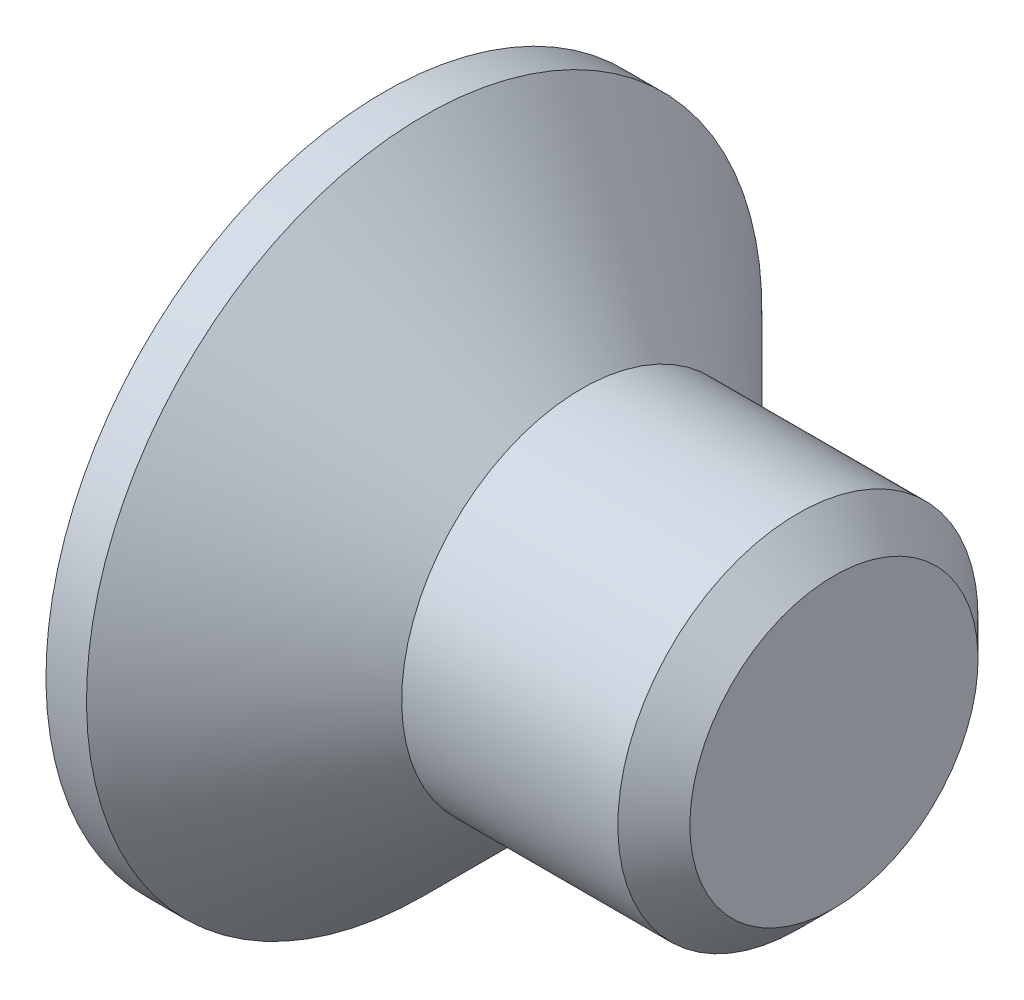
ISO-10303-21;
HEADER;
FILE_DESCRIPTION(('STEP AP214'),'2;1');
FILE_NAME('part.step','',(''),(''),'','','');
FILE_SCHEMA(('AUTOMOTIVE_DESIGN { 1 0 10303 214 1 1 1 1 }'));
ENDSEC;
DATA;
#1=APPLICATION_CONTEXT('core data for automotive mechanical design processes');
#2=APPLICATION_PROTOCOL_DEFINITION('international standard','automotive_design',2000,#1);
#3=PRODUCT_CONTEXT('',#1,'mechanical');
#4=PRODUCT('Part','Part','',(#3));
#5=PRODUCT_RELATED_PRODUCT_CATEGORY('part','',(#4));
#6=PRODUCT_DEFINITION_FORMATION('','',#4);
#7=PRODUCT_DEFINITION_CONTEXT('part definition',#1,'design');
#8=PRODUCT_DEFINITION('design','',#6,#7);
#9=PRODUCT_DEFINITION_SHAPE('','',#8);
#10=(LENGTH_UNIT() NAMED_UNIT(*) SI_UNIT(.MILLI.,.METRE.));
#11=(NAMED_UNIT(*) PLANE_ANGLE_UNIT() SI_UNIT($,.RADIAN.));
#12=(NAMED_UNIT(*) SI_UNIT($,.STERADIAN.) SOLID_ANGLE_UNIT());
#13=UNCERTAINTY_MEASURE_WITH_UNIT(LENGTH_MEASURE(1.E-05),#10,'distance_accuracy_value','');
#14=(GEOMETRIC_REPRESENTATION_CONTEXT(3) GLOBAL_UNCERTAINTY_ASSIGNED_CONTEXT((#13)) GLOBAL_UNIT_ASSIGNED_CONTEXT((#10,
#11,#12)) REPRESENTATION_CONTEXT('',''));
#15=CARTESIAN_POINT('',(0.,0.,0.));
#16=DIRECTION('',(0.,0.,1.));
#17=DIRECTION('',(1.,0.,0.));
#18=AXIS2_PLACEMENT_3D('',#15,#16,#17);
#19=CARTESIAN_POINT('',(0.,0.,0.));
#20=DIRECTION('',(-1.,0.,0.));
#21=DIRECTION('',(0.,-1.,0.));
#22=AXIS2_PLACEMENT_3D('',#19,#20,#21);
#23=CONICAL_SURFACE('',#22,2.,0.78539816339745);
#24=CARTESIAN_POINT('',(-1.74999999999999,0.,0.));
#25=DIRECTION('',(-1.,0.,0.));
#26=DIRECTION('',(0.,-1.,0.));
#27=AXIS2_PLACEMENT_3D('',#24,#25,#26);
#28=CIRCLE('',#27,3.75);
#29=CARTESIAN_POINT('',(-1.74999999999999,-3.75,0.));
#30=VERTEX_POINT('',#29);
#31=EDGE_CURVE('E189',#30,#30,#28,.T.);
#32=ORIENTED_EDGE('',*,*,#31,.F.);
#33=EDGE_LOOP('',(#32));
#34=FACE_BOUND('',#33,.T.);
#35=CARTESIAN_POINT('',(0.,0.,0.));
#36=DIRECTION('',(-1.,0.,0.));
#37=DIRECTION('',(0.,-1.,0.));
#38=AXIS2_PLACEMENT_3D('',#35,#36,#37);
#39=CIRCLE('',#38,2.);
#40=CARTESIAN_POINT('',(0.,-2.,0.));
#41=VERTEX_POINT('',#40);
#42=EDGE_CURVE('E212',#41,#41,#39,.T.);
#43=ORIENTED_EDGE('',*,*,#42,.T.);
#44=EDGE_LOOP('',(#43));
#45=FACE_BOUND('',#44,.T.);
#46=ADVANCED_FACE('F33',(#34,#45),#23,.T.);
#47=CARTESIAN_POINT('',(-2.2,0.,0.));
#48=DIRECTION('',(-1.,0.,0.));
#49=DIRECTION('',(0.,-1.,0.));
#50=AXIS2_PLACEMENT_3D('',#47,#48,#49);
#51=CYLINDRICAL_SURFACE('',#50,2.);
#52=CARTESIAN_POINT('',(2.4,0.,0.));
#53=DIRECTION('',(-1.,0.,0.));
#54=DIRECTION('',(0.,-1.,0.));
#55=AXIS2_PLACEMENT_3D('',#52,#53,#54);
#56=CIRCLE('',#55,2.);
#57=CARTESIAN_POINT('',(2.4,-2.,0.));
#58=VERTEX_POINT('',#57);
#59=EDGE_CURVE('E41',#58,#58,#56,.T.);
#60=ORIENTED_EDGE('',*,*,#59,.T.);
#61=EDGE_LOOP('',(#60));
#62=FACE_BOUND('',#61,.T.);
#63=ORIENTED_EDGE('',*,*,#42,.F.);
#64=EDGE_LOOP('',(#63));
#65=FACE_BOUND('',#64,.T.);
#66=ADVANCED_FACE('F217',(#62,#65),#51,.T.);
#67=CARTESIAN_POINT('',(2.8,0.,0.));
#68=DIRECTION('',(-1.,0.,0.));
#69=DIRECTION('',(0.,-1.,0.));
#70=AXIS2_PLACEMENT_3D('',#67,#68,#69);
#71=PLANE('',#70);
#72=CARTESIAN_POINT('',(2.8,0.,0.));
#73=DIRECTION('',(-1.,0.,0.));
#74=DIRECTION('',(0.,-1.,0.));
#75=AXIS2_PLACEMENT_3D('',#72,#73,#74);
#76=CIRCLE('',#75,1.6);
#77=CARTESIAN_POINT('',(2.8,-1.6,0.));
#78=VERTEX_POINT('',#77);
#79=EDGE_CURVE('E11',#78,#78,#76,.F.);
#80=ORIENTED_EDGE('',*,*,#79,.T.);
#81=EDGE_LOOP('',(#80));
#82=FACE_BOUND('',#81,.T.);
#83=ADVANCED_FACE('F239',(#82),#71,.F.);
#84=CARTESIAN_POINT('',(-2.2,3.75,0.));
#85=DIRECTION('',(1.,0.,0.));
#86=DIRECTION('',(0.,1.,0.));
#87=AXIS2_PLACEMENT_3D('',#84,#85,#86);
#88=PLANE('',#87);
#89=DIRECTION('',(0.,0.,-1.));
#90=VECTOR('',#89,1.);
#91=CARTESIAN_POINT('',(-2.2,0.55,-2.2));
#92=LINE('',#91,#90);
#93=CARTESIAN_POINT('',(-2.2,0.55,-0.55));
#94=VERTEX_POINT('',#93);
#95=CARTESIAN_POINT('',(-2.2,0.55,-2.2));
#96=VERTEX_POINT('',#95);
#97=EDGE_CURVE('E158',#94,#96,#92,.T.);
#98=ORIENTED_EDGE('',*,*,#97,.F.);
#99=DIRECTION('',(0.,-1.,0.));
#100=VECTOR('',#99,1.);
#101=CARTESIAN_POINT('',(-2.2,0.55,-0.55));
#102=LINE('',#101,#100);
#103=CARTESIAN_POINT('',(-2.2,2.2,-0.55));
#104=VERTEX_POINT('',#103);
#105=EDGE_CURVE('E48',#104,#94,#102,.T.);
#106=ORIENTED_EDGE('',*,*,#105,.F.);
#107=DIRECTION('',(0.,0.,-1.));
#108=VECTOR('',#107,1.);
#109=CARTESIAN_POINT('',(-2.2,2.2,-0.55));
#110=LINE('',#109,#108);
#111=CARTESIAN_POINT('',(-2.2,2.2,0.55));
#112=VERTEX_POINT('',#111);
#113=EDGE_CURVE('E185',#112,#104,#110,.T.);
#114=ORIENTED_EDGE('',*,*,#113,.F.);
#115=DIRECTION('',(0.,1.,0.));
#116=VECTOR('',#115,1.);
#117=CARTESIAN_POINT('',(-2.2,2.2,0.55));
#118=LINE('',#117,#116);
#119=CARTESIAN_POINT('',(-2.2,0.55,0.55));
#120=VERTEX_POINT('',#119);
#121=EDGE_CURVE('E183',#120,#112,#118,.T.);
#122=ORIENTED_EDGE('',*,*,#121,.F.);
#123=DIRECTION('',(0.,0.,-1.));
#124=VECTOR('',#123,1.);
#125=CARTESIAN_POINT('',(-2.2,0.55,0.55));
#126=LINE('',#125,#124);
#127=CARTESIAN_POINT('',(-2.2,0.55,2.2));
#128=VERTEX_POINT('',#127);
#129=EDGE_CURVE('E132',#128,#120,#126,.T.);
#130=ORIENTED_EDGE('',*,*,#129,.F.);
#131=DIRECTION('',(0.,1.,0.));
#132=VECTOR('',#131,1.);
#133=CARTESIAN_POINT('',(-2.2,0.55,2.2));
#134=LINE('',#133,#132);
#135=CARTESIAN_POINT('',(-2.2,-0.55,2.2));
#136=VERTEX_POINT('',#135);
#137=EDGE_CURVE('E179',#136,#128,#134,.T.);
#138=ORIENTED_EDGE('',*,*,#137,.F.);
#139=DIRECTION('',(0.,0.,1.));
#140=VECTOR('',#139,1.);
#141=CARTESIAN_POINT('',(-2.2,-0.55,2.2));
#142=LINE('',#141,#140);
#143=CARTESIAN_POINT('',(-2.2,-0.55,0.55));
#144=VERTEX_POINT('',#143);
#145=EDGE_CURVE('E176',#144,#136,#142,.T.);
#146=ORIENTED_EDGE('',*,*,#145,.F.);
#147=DIRECTION('',(0.,1.,0.));
#148=VECTOR('',#147,1.);
#149=CARTESIAN_POINT('',(-2.2,-0.55,0.55));
#150=LINE('',#149,#148);
#151=CARTESIAN_POINT('',(-2.2,-2.2,0.55));
#152=VERTEX_POINT('',#151);
#153=EDGE_CURVE('E173',#152,#144,#150,.T.);
#154=ORIENTED_EDGE('',*,*,#153,.F.);
#155=DIRECTION('',(0.,0.,1.));
#156=VECTOR('',#155,1.);
#157=CARTESIAN_POINT('',(-2.2,-2.2,0.55));
#158=LINE('',#157,#156);
#159=CARTESIAN_POINT('',(-2.2,-2.2,-0.55));
#160=VERTEX_POINT('',#159);
#161=EDGE_CURVE('E170',#160,#152,#158,.T.);
#162=ORIENTED_EDGE('',*,*,#161,.F.);
#163=DIRECTION('',(0.,-1.,0.));
#164=VECTOR('',#163,1.);
#165=CARTESIAN_POINT('',(-2.2,-2.2,-0.55));
#166=LINE('',#165,#164);
#167=CARTESIAN_POINT('',(-2.2,-0.55,-0.55));
#168=VERTEX_POINT('',#167);
#169=EDGE_CURVE('E167',#168,#160,#166,.T.);
#170=ORIENTED_EDGE('',*,*,#169,.F.);
#171=DIRECTION('',(0.,0.,1.));
#172=VECTOR('',#171,1.);
#173=CARTESIAN_POINT('',(-2.2,-0.55,-0.55));
#174=LINE('',#173,#172);
#175=CARTESIAN_POINT('',(-2.2,-0.55,-2.2));
#176=VERTEX_POINT('',#175);
#177=EDGE_CURVE('E164',#176,#168,#174,.T.);
#178=ORIENTED_EDGE('',*,*,#177,.F.);
#179=DIRECTION('',(0.,-1.,0.));
#180=VECTOR('',#179,1.);
#181=CARTESIAN_POINT('',(-2.2,-0.55,-2.2));
#182=LINE('',#181,#180);
#183=EDGE_CURVE('E161',#96,#176,#182,.T.);
#184=ORIENTED_EDGE('',*,*,#183,.F.);
#185=EDGE_LOOP('',(#98,#106,#114,#122,#130,#138,#146,#154,#162,#170,#178,#184));
#186=FACE_BOUND('',#185,.T.);
#187=CARTESIAN_POINT('',(-2.2,0.,0.));
#188=DIRECTION('',(-1.,0.,0.));
#189=DIRECTION('',(0.,-1.,0.));
#190=AXIS2_PLACEMENT_3D('',#187,#188,#189);
#191=CIRCLE('',#190,3.75);
#192=CARTESIAN_POINT('',(-2.2,-3.75,0.));
#193=VERTEX_POINT('',#192);
#194=EDGE_CURVE('E209',#193,#193,#191,.T.);
#195=ORIENTED_EDGE('',*,*,#194,.T.);
#196=EDGE_LOOP('',(#195));
#197=FACE_BOUND('',#196,.T.);
#198=ADVANCED_FACE('F230',(#186,#197),#88,.F.);
#199=CARTESIAN_POINT('',(-2.2,0.,0.));
#200=DIRECTION('',(-1.,0.,0.));
#201=DIRECTION('',(0.,-1.,0.));
#202=AXIS2_PLACEMENT_3D('',#199,#200,#201);
#203=CYLINDRICAL_SURFACE('',#202,3.75);
#204=ORIENTED_EDGE('',*,*,#194,.F.);
#205=EDGE_LOOP('',(#204));
#206=FACE_BOUND('',#205,.T.);
#207=ORIENTED_EDGE('',*,*,#31,.T.);
#208=EDGE_LOOP('',(#207));
#209=FACE_BOUND('',#208,.T.);
#210=ADVANCED_FACE('F222',(#206,#209),#203,.T.);
#211=CARTESIAN_POINT('',(2.4,0.,0.));
#212=DIRECTION('',(-1.,0.,0.));
#213=DIRECTION('',(0.,-1.,0.));
#214=AXIS2_PLACEMENT_3D('',#211,#212,#213);
#215=CONICAL_SURFACE('',#214,2.,0.78539816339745);
#216=ORIENTED_EDGE('',*,*,#79,.F.);
#217=EDGE_LOOP('',(#216));
#218=FACE_BOUND('',#217,.T.);
#219=ORIENTED_EDGE('',*,*,#59,.F.);
#220=EDGE_LOOP('',(#219));
#221=FACE_BOUND('',#220,.T.);
#222=ADVANCED_FACE('F35',(#218,#221),#215,.T.);
#223=CARTESIAN_POINT('',(-0.3,0.55,-0.55));
#224=DIRECTION('',(0.,0.,-1.));
#225=DIRECTION('',(-1.,0.,0.));
#226=AXIS2_PLACEMENT_3D('',#223,#224,#225);
#227=PLANE('',#226);
#228=ORIENTED_EDGE('',*,*,#105,.T.);
#229=DIRECTION('',(-1.,0.,0.));
#230=VECTOR('',#229,1.);
#231=CARTESIAN_POINT('',(-0.3,0.55,-0.55));
#232=LINE('',#231,#230);
#233=CARTESIAN_POINT('',(-0.3,0.55,-0.55));
#234=VERTEX_POINT('',#233);
#235=EDGE_CURVE('E96',#234,#94,#232,.T.);
#236=ORIENTED_EDGE('',*,*,#235,.F.);
#237=DIRECTION('',(0.,-1.,0.));
#238=VECTOR('',#237,1.);
#239=CARTESIAN_POINT('',(-0.3,0.55,-0.55));
#240=LINE('',#239,#238);
#241=CARTESIAN_POINT('',(-0.3,2.2,-0.55));
#242=VERTEX_POINT('',#241);
#243=EDGE_CURVE('E187',#242,#234,#240,.T.);
#244=ORIENTED_EDGE('',*,*,#243,.F.);
#245=DIRECTION('',(-1.,0.,0.));
#246=VECTOR('',#245,1.);
#247=CARTESIAN_POINT('',(-0.3,2.2,-0.55));
#248=LINE('',#247,#246);
#249=EDGE_CURVE('E56',#242,#104,#248,.T.);
#250=ORIENTED_EDGE('',*,*,#249,.T.);
#251=EDGE_LOOP('',(#228,#236,#244,#250));
#252=FACE_BOUND('',#251,.T.);
#253=ADVANCED_FACE('F221',(#252),#227,.F.);
#254=CARTESIAN_POINT('',(-0.3,2.2,-0.55));
#255=DIRECTION('',(0.,1.,0.));
#256=DIRECTION('',(-1.,0.,0.));
#257=AXIS2_PLACEMENT_3D('',#254,#255,#256);
#258=PLANE('',#257);
#259=ORIENTED_EDGE('',*,*,#113,.T.);
#260=ORIENTED_EDGE('',*,*,#249,.F.);
#261=DIRECTION('',(0.,0.,-1.));
#262=VECTOR('',#261,1.);
#263=CARTESIAN_POINT('',(-0.3,2.2,-0.55));
#264=LINE('',#263,#262);
#265=CARTESIAN_POINT('',(-0.3,2.2,0.55));
#266=VERTEX_POINT('',#265);
#267=EDGE_CURVE('E144',#266,#242,#264,.T.);
#268=ORIENTED_EDGE('',*,*,#267,.F.);
#269=DIRECTION('',(-1.,0.,0.));
#270=VECTOR('',#269,1.);
#271=CARTESIAN_POINT('',(-0.3,2.2,0.55));
#272=LINE('',#271,#270);
#273=EDGE_CURVE('E136',#266,#112,#272,.T.);
#274=ORIENTED_EDGE('',*,*,#273,.T.);
#275=EDGE_LOOP('',(#259,#260,#268,#274));
#276=FACE_BOUND('',#275,.T.);
#277=ADVANCED_FACE('F228',(#276),#258,.F.);
#278=CARTESIAN_POINT('',(-0.3,2.2,0.55));
#279=DIRECTION('',(0.,0.,1.));
#280=DIRECTION('',(1.,0.,0.));
#281=AXIS2_PLACEMENT_3D('',#278,#279,#280);
#282=PLANE('',#281);
#283=ORIENTED_EDGE('',*,*,#121,.T.);
#284=ORIENTED_EDGE('',*,*,#273,.F.);
#285=DIRECTION('',(0.,1.,0.));
#286=VECTOR('',#285,1.);
#287=CARTESIAN_POINT('',(-0.3,2.2,0.55));
#288=LINE('',#287,#286);
#289=CARTESIAN_POINT('',(-0.3,0.55,0.55));
#290=VERTEX_POINT('',#289);
#291=EDGE_CURVE('E140',#290,#266,#288,.T.);
#292=ORIENTED_EDGE('',*,*,#291,.F.);
#293=DIRECTION('',(-1.,0.,0.));
#294=VECTOR('',#293,1.);
#295=CARTESIAN_POINT('',(-0.3,0.55,0.55));
#296=LINE('',#295,#294);
#297=EDGE_CURVE('E125',#290,#120,#296,.T.);
#298=ORIENTED_EDGE('',*,*,#297,.T.);
#299=EDGE_LOOP('',(#283,#284,#292,#298));
#300=FACE_BOUND('',#299,.T.);
#301=ADVANCED_FACE('F141',(#300),#282,.F.);
#302=CARTESIAN_POINT('',(-0.3,0.55,0.55));
#303=DIRECTION('',(0.,1.,0.));
#304=DIRECTION('',(-1.,0.,0.));
#305=AXIS2_PLACEMENT_3D('',#302,#303,#304);
#306=PLANE('',#305);
#307=ORIENTED_EDGE('',*,*,#129,.T.);
#308=ORIENTED_EDGE('',*,*,#297,.F.);
#309=DIRECTION('',(0.,0.,-1.));
#310=VECTOR('',#309,1.);
#311=CARTESIAN_POINT('',(-0.3,0.55,0.55));
#312=LINE('',#311,#310);
#313=CARTESIAN_POINT('',(-0.3,0.55,2.2));
#314=VERTEX_POINT('',#313);
#315=EDGE_CURVE('E129',#314,#290,#312,.T.);
#316=ORIENTED_EDGE('',*,*,#315,.F.);
#317=DIRECTION('',(-1.,0.,0.));
#318=VECTOR('',#317,1.);
#319=CARTESIAN_POINT('',(-0.3,0.55,2.2));
#320=LINE('',#319,#318);
#321=EDGE_CURVE('E137',#314,#128,#320,.T.);
#322=ORIENTED_EDGE('',*,*,#321,.T.);
#323=EDGE_LOOP('',(#307,#308,#316,#322));
#324=FACE_BOUND('',#323,.T.);
#325=ADVANCED_FACE('F127',(#324),#306,.F.);
#326=CARTESIAN_POINT('',(-0.3,0.55,2.2));
#327=DIRECTION('',(0.,0.,1.));
#328=DIRECTION('',(1.,0.,0.));
#329=AXIS2_PLACEMENT_3D('',#326,#327,#328);
#330=PLANE('',#329);
#331=ORIENTED_EDGE('',*,*,#137,.T.);
#332=ORIENTED_EDGE('',*,*,#321,.F.);
#333=DIRECTION('',(0.,1.,0.));
#334=VECTOR('',#333,1.);
#335=CARTESIAN_POINT('',(-0.3,0.55,2.2));
#336=LINE('',#335,#334);
#337=CARTESIAN_POINT('',(-0.3,-0.55,2.2));
#338=VERTEX_POINT('',#337);
#339=EDGE_CURVE('E150',#338,#314,#336,.T.);
#340=ORIENTED_EDGE('',*,*,#339,.F.);
#341=DIRECTION('',(-1.,0.,0.));
#342=VECTOR('',#341,1.);
#343=CARTESIAN_POINT('',(-0.3,-0.55,2.2));
#344=LINE('',#343,#342);
#345=EDGE_CURVE('E192',#338,#136,#344,.T.);
#346=ORIENTED_EDGE('',*,*,#345,.T.);
#347=EDGE_LOOP('',(#331,#332,#340,#346));
#348=FACE_BOUND('',#347,.T.);
#349=ADVANCED_FACE('F277',(#348),#330,.F.);
#350=CARTESIAN_POINT('',(-0.3,-0.55,2.2));
#351=DIRECTION('',(0.,-1.,0.));
#352=DIRECTION('',(1.,0.,0.));
#353=AXIS2_PLACEMENT_3D('',#350,#351,#352);
#354=PLANE('',#353);
#355=ORIENTED_EDGE('',*,*,#145,.T.);
#356=ORIENTED_EDGE('',*,*,#345,.F.);
#357=DIRECTION('',(0.,0.,1.));
#358=VECTOR('',#357,1.);
#359=CARTESIAN_POINT('',(-0.3,-0.55,2.2));
#360=LINE('',#359,#358);
#361=CARTESIAN_POINT('',(-0.3,-0.55,0.55));
#362=VERTEX_POINT('',#361);
#363=EDGE_CURVE('E152',#362,#338,#360,.T.);
#364=ORIENTED_EDGE('',*,*,#363,.F.);
#365=DIRECTION('',(-1.,0.,0.));
#366=VECTOR('',#365,1.);
#367=CARTESIAN_POINT('',(-0.3,-0.55,0.55));
#368=LINE('',#367,#366);
#369=EDGE_CURVE('E194',#362,#144,#368,.T.);
#370=ORIENTED_EDGE('',*,*,#369,.T.);
#371=EDGE_LOOP('',(#355,#356,#364,#370));
#372=FACE_BOUND('',#371,.T.);
#373=ADVANCED_FACE('F273',(#372),#354,.F.);
#374=CARTESIAN_POINT('',(-0.3,-0.55,0.55));
#375=DIRECTION('',(0.,0.,1.));
#376=DIRECTION('',(1.,0.,0.));
#377=AXIS2_PLACEMENT_3D('',#374,#375,#376);
#378=PLANE('',#377);
#379=ORIENTED_EDGE('',*,*,#153,.T.);
#380=ORIENTED_EDGE('',*,*,#369,.F.);
#381=DIRECTION('',(0.,1.,0.));
#382=VECTOR('',#381,1.);
#383=CARTESIAN_POINT('',(-0.3,-0.55,0.55));
#384=LINE('',#383,#382);
#385=CARTESIAN_POINT('',(-0.3,-2.2,0.55));
#386=VERTEX_POINT('',#385);
#387=EDGE_CURVE('E422',#386,#362,#384,.T.);
#388=ORIENTED_EDGE('',*,*,#387,.F.);
#389=DIRECTION('',(-1.,0.,0.));
#390=VECTOR('',#389,1.);
#391=CARTESIAN_POINT('',(-0.3,-2.2,0.55));
#392=LINE('',#391,#390);
#393=EDGE_CURVE('E196',#386,#152,#392,.T.);
#394=ORIENTED_EDGE('',*,*,#393,.T.);
#395=EDGE_LOOP('',(#379,#380,#388,#394));
#396=FACE_BOUND('',#395,.T.);
#397=ADVANCED_FACE('F269',(#396),#378,.F.);
#398=CARTESIAN_POINT('',(-0.3,-2.2,0.55));
#399=DIRECTION('',(0.,-1.,0.));
#400=DIRECTION('',(1.,0.,0.));
#401=AXIS2_PLACEMENT_3D('',#398,#399,#400);
#402=PLANE('',#401);
#403=ORIENTED_EDGE('',*,*,#161,.T.);
#404=ORIENTED_EDGE('',*,*,#393,.F.);
#405=DIRECTION('',(0.,0.,1.));
#406=VECTOR('',#405,1.);
#407=CARTESIAN_POINT('',(-0.3,-2.2,0.55));
#408=LINE('',#407,#406);
#409=CARTESIAN_POINT('',(-0.3,-2.2,-0.55));
#410=VERTEX_POINT('',#409);
#411=EDGE_CURVE('E419',#410,#386,#408,.T.);
#412=ORIENTED_EDGE('',*,*,#411,.F.);
#413=DIRECTION('',(-1.,0.,0.));
#414=VECTOR('',#413,1.);
#415=CARTESIAN_POINT('',(-0.3,-2.2,-0.55));
#416=LINE('',#415,#414);
#417=EDGE_CURVE('E198',#410,#160,#416,.T.);
#418=ORIENTED_EDGE('',*,*,#417,.T.);
#419=EDGE_LOOP('',(#403,#404,#412,#418));
#420=FACE_BOUND('',#419,.T.);
#421=ADVANCED_FACE('F265',(#420),#402,.F.);
#422=CARTESIAN_POINT('',(-0.3,-2.2,-0.55));
#423=DIRECTION('',(0.,0.,-1.));
#424=DIRECTION('',(-1.,0.,0.));
#425=AXIS2_PLACEMENT_3D('',#422,#423,#424);
#426=PLANE('',#425);
#427=ORIENTED_EDGE('',*,*,#169,.T.);
#428=ORIENTED_EDGE('',*,*,#417,.F.);
#429=DIRECTION('',(0.,-1.,0.));
#430=VECTOR('',#429,1.);
#431=CARTESIAN_POINT('',(-0.3,-2.2,-0.55));
#432=LINE('',#431,#430);
#433=CARTESIAN_POINT('',(-0.3,-0.55,-0.55));
#434=VERTEX_POINT('',#433);
#435=EDGE_CURVE('E416',#434,#410,#432,.T.);
#436=ORIENTED_EDGE('',*,*,#435,.F.);
#437=DIRECTION('',(-1.,0.,0.));
#438=VECTOR('',#437,1.);
#439=CARTESIAN_POINT('',(-0.3,-0.55,-0.55));
#440=LINE('',#439,#438);
#441=EDGE_CURVE('E200',#434,#168,#440,.T.);
#442=ORIENTED_EDGE('',*,*,#441,.T.);
#443=EDGE_LOOP('',(#427,#428,#436,#442));
#444=FACE_BOUND('',#443,.T.);
#445=ADVANCED_FACE('F261',(#444),#426,.F.);
#446=CARTESIAN_POINT('',(-0.3,-0.55,-0.55));
#447=DIRECTION('',(0.,-1.,0.));
#448=DIRECTION('',(1.,0.,0.));
#449=AXIS2_PLACEMENT_3D('',#446,#447,#448);
#450=PLANE('',#449);
#451=ORIENTED_EDGE('',*,*,#177,.T.);
#452=ORIENTED_EDGE('',*,*,#441,.F.);
#453=DIRECTION('',(0.,0.,1.));
#454=VECTOR('',#453,1.);
#455=CARTESIAN_POINT('',(-0.3,-0.55,-0.55));
#456=LINE('',#455,#454);
#457=CARTESIAN_POINT('',(-0.3,-0.55,-2.2));
#458=VERTEX_POINT('',#457);
#459=EDGE_CURVE('E413',#458,#434,#456,.T.);
#460=ORIENTED_EDGE('',*,*,#459,.F.);
#461=DIRECTION('',(-1.,0.,0.));
#462=VECTOR('',#461,1.);
#463=CARTESIAN_POINT('',(-0.3,-0.55,-2.2));
#464=LINE('',#463,#462);
#465=EDGE_CURVE('E202',#458,#176,#464,.T.);
#466=ORIENTED_EDGE('',*,*,#465,.T.);
#467=EDGE_LOOP('',(#451,#452,#460,#466));
#468=FACE_BOUND('',#467,.T.);
#469=ADVANCED_FACE('F257',(#468),#450,.F.);
#470=CARTESIAN_POINT('',(-0.3,-0.55,-2.2));
#471=DIRECTION('',(0.,0.,-1.));
#472=DIRECTION('',(-1.,0.,0.));
#473=AXIS2_PLACEMENT_3D('',#470,#471,#472);
#474=PLANE('',#473);
#475=ORIENTED_EDGE('',*,*,#183,.T.);
#476=ORIENTED_EDGE('',*,*,#465,.F.);
#477=DIRECTION('',(0.,-1.,0.));
#478=VECTOR('',#477,1.);
#479=CARTESIAN_POINT('',(-0.3,-0.55,-2.2));
#480=LINE('',#479,#478);
#481=CARTESIAN_POINT('',(-0.3,0.55,-2.2));
#482=VERTEX_POINT('',#481);
#483=EDGE_CURVE('E408',#482,#458,#480,.T.);
#484=ORIENTED_EDGE('',*,*,#483,.F.);
#485=DIRECTION('',(-1.,0.,0.));
#486=VECTOR('',#485,1.);
#487=CARTESIAN_POINT('',(-0.3,0.55,-2.2));
#488=LINE('',#487,#486);
#489=EDGE_CURVE('E204',#482,#96,#488,.T.);
#490=ORIENTED_EDGE('',*,*,#489,.T.);
#491=EDGE_LOOP('',(#475,#476,#484,#490));
#492=FACE_BOUND('',#491,.T.);
#493=ADVANCED_FACE('F253',(#492),#474,.F.);
#494=CARTESIAN_POINT('',(-0.3,0.55,-2.2));
#495=DIRECTION('',(0.,1.,0.));
#496=DIRECTION('',(-1.,0.,0.));
#497=AXIS2_PLACEMENT_3D('',#494,#495,#496);
#498=PLANE('',#497);
#499=ORIENTED_EDGE('',*,*,#97,.T.);
#500=ORIENTED_EDGE('',*,*,#489,.F.);
#501=DIRECTION('',(0.,0.,-1.));
#502=VECTOR('',#501,1.);
#503=CARTESIAN_POINT('',(-0.3,0.55,-2.2));
#504=LINE('',#503,#502);
#505=EDGE_CURVE('E406',#234,#482,#504,.T.);
#506=ORIENTED_EDGE('',*,*,#505,.F.);
#507=ORIENTED_EDGE('',*,*,#235,.T.);
#508=EDGE_LOOP('',(#499,#500,#506,#507));
#509=FACE_BOUND('',#508,.T.);
#510=ADVANCED_FACE('F250',(#509),#498,.F.);
#511=CARTESIAN_POINT('',(-0.3,0.,0.));
#512=DIRECTION('',(1.,0.,0.));
#513=DIRECTION('',(0.,0.,-1.));
#514=AXIS2_PLACEMENT_3D('',#511,#512,#513);
#515=PLANE('',#514);
#516=ORIENTED_EDGE('',*,*,#243,.T.);
#517=ORIENTED_EDGE('',*,*,#505,.T.);
#518=ORIENTED_EDGE('',*,*,#483,.T.);
#519=ORIENTED_EDGE('',*,*,#459,.T.);
#520=ORIENTED_EDGE('',*,*,#435,.T.);
#521=ORIENTED_EDGE('',*,*,#411,.T.);
#522=ORIENTED_EDGE('',*,*,#387,.T.);
#523=ORIENTED_EDGE('',*,*,#363,.T.);
#524=ORIENTED_EDGE('',*,*,#339,.T.);
#525=ORIENTED_EDGE('',*,*,#315,.T.);
#526=ORIENTED_EDGE('',*,*,#291,.T.);
#527=ORIENTED_EDGE('',*,*,#267,.T.);
#528=EDGE_LOOP('',(#516,#517,#518,#519,#520,#521,#522,#523,#524,#525,#526,#527));
#529=FACE_BOUND('',#528,.T.);
#530=ADVANCED_FACE('F147',(#529),#515,.F.);
#531=CLOSED_SHELL('',(#46,#66,#83,#198,#210,#222,#253,#277,#301,#325,#349,#373,#397,#421,#445,
#469,#493,#510,#530));
#532=MANIFOLD_SOLID_BREP('B2',#531);
#533=ADVANCED_BREP_SHAPE_REPRESENTATION('',(#18,#532),#14);
#534=SHAPE_DEFINITION_REPRESENTATION(#9,#533);
ENDSEC;
END-ISO-10303-21;
